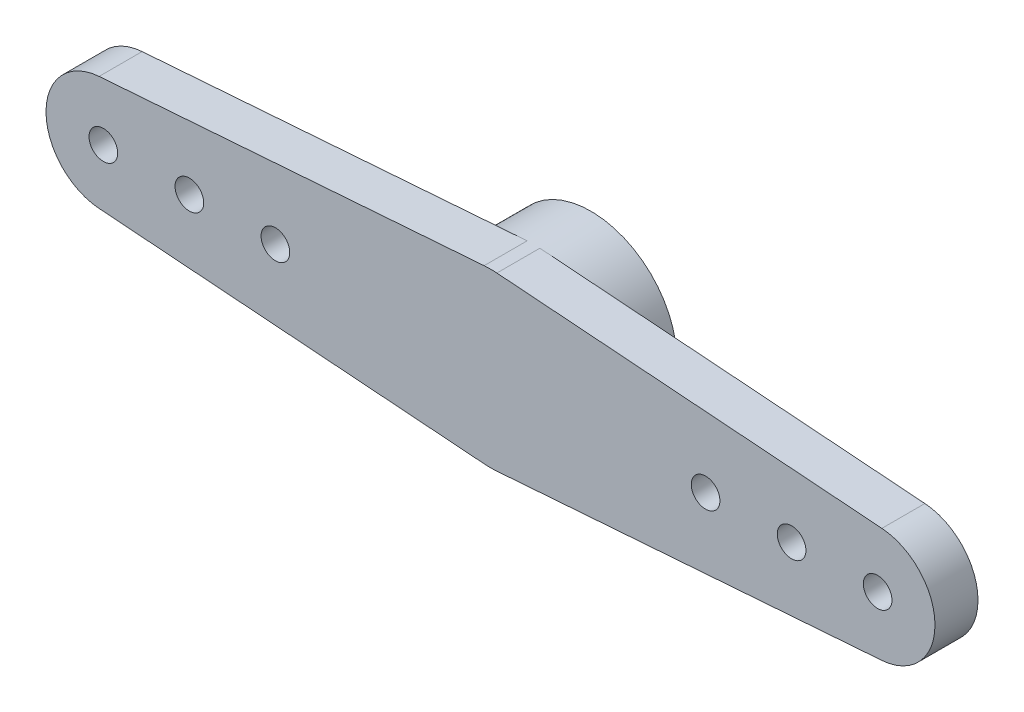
ISO-10303-21;
HEADER;
FILE_DESCRIPTION(('STEP AP214'),'2;1');
FILE_NAME('part.step','',(''),(''),'','','');
FILE_SCHEMA(('AUTOMOTIVE_DESIGN { 1 0 10303 214 1 1 1 1 }'));
ENDSEC;
DATA;
#1=APPLICATION_CONTEXT('core data for automotive mechanical design processes');
#2=APPLICATION_PROTOCOL_DEFINITION('international standard','automotive_design',2000,#1);
#3=PRODUCT_CONTEXT('',#1,'mechanical');
#4=PRODUCT('Part','Part','',(#3));
#5=PRODUCT_RELATED_PRODUCT_CATEGORY('part','',(#4));
#6=PRODUCT_DEFINITION_FORMATION('','',#4);
#7=PRODUCT_DEFINITION_CONTEXT('part definition',#1,'design');
#8=PRODUCT_DEFINITION('design','',#6,#7);
#9=PRODUCT_DEFINITION_SHAPE('','',#8);
#10=(LENGTH_UNIT() NAMED_UNIT(*) SI_UNIT(.MILLI.,.METRE.));
#11=(NAMED_UNIT(*) PLANE_ANGLE_UNIT() SI_UNIT($,.RADIAN.));
#12=(NAMED_UNIT(*) SI_UNIT($,.STERADIAN.) SOLID_ANGLE_UNIT());
#13=UNCERTAINTY_MEASURE_WITH_UNIT(LENGTH_MEASURE(1.E-05),#10,'distance_accuracy_value','');
#14=(GEOMETRIC_REPRESENTATION_CONTEXT(3) GLOBAL_UNCERTAINTY_ASSIGNED_CONTEXT((#13)) GLOBAL_UNIT_ASSIGNED_CONTEXT((#10,
#11,#12)) REPRESENTATION_CONTEXT('',''));
#15=CARTESIAN_POINT('',(0.,0.,0.));
#16=DIRECTION('',(0.,0.,1.));
#17=DIRECTION('',(1.,0.,0.));
#18=AXIS2_PLACEMENT_3D('',#15,#16,#17);
#19=CARTESIAN_POINT('',(0.,0.,0.));
#20=DIRECTION('',(0.,0.,1.));
#21=DIRECTION('',(1.,0.,0.));
#22=AXIS2_PLACEMENT_3D('',#19,#20,#21);
#23=PLANE('',#22);
#24=CARTESIAN_POINT('',(-10.5,0.,0.));
#25=DIRECTION('',(0.,0.,1.));
#26=DIRECTION('',(1.,0.,0.));
#27=AXIS2_PLACEMENT_3D('',#24,#25,#26);
#28=CIRCLE('',#27,0.500000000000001);
#29=CARTESIAN_POINT('',(-10.,0.,0.));
#30=VERTEX_POINT('',#29);
#31=EDGE_CURVE('E181',#30,#30,#28,.T.);
#32=ORIENTED_EDGE('',*,*,#31,.T.);
#33=EDGE_LOOP('',(#32));
#34=FACE_BOUND('',#33,.T.);
#35=CARTESIAN_POINT('',(-13.5,0.,0.));
#36=DIRECTION('',(0.,0.,1.));
#37=DIRECTION('',(1.,0.,0.));
#38=AXIS2_PLACEMENT_3D('',#35,#36,#37);
#39=CIRCLE('',#38,0.500000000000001);
#40=CARTESIAN_POINT('',(-13.,0.,0.));
#41=VERTEX_POINT('',#40);
#42=EDGE_CURVE('E175',#41,#41,#39,.T.);
#43=ORIENTED_EDGE('',*,*,#42,.T.);
#44=EDGE_LOOP('',(#43));
#45=FACE_BOUND('',#44,.T.);
#46=CARTESIAN_POINT('',(-7.5,0.,0.));
#47=DIRECTION('',(0.,0.,1.));
#48=DIRECTION('',(1.,0.,0.));
#49=AXIS2_PLACEMENT_3D('',#46,#47,#48);
#50=CIRCLE('',#49,0.500000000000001);
#51=CARTESIAN_POINT('',(-7.,0.,0.));
#52=VERTEX_POINT('',#51);
#53=EDGE_CURVE('E187',#52,#52,#50,.T.);
#54=ORIENTED_EDGE('',*,*,#53,.T.);
#55=EDGE_LOOP('',(#54));
#56=FACE_BOUND('',#55,.T.);
#57=DIRECTION('',(-0.997252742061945,-0.074074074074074,0.));
#58=VECTOR('',#57,1.);
#59=CARTESIAN_POINT('',(-13.6481481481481,1.99450548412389,0.));
#60=LINE('',#59,#58);
#61=CARTESIAN_POINT('',(-0.222222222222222,2.99175822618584,0.));
#62=VERTEX_POINT('',#61);
#63=CARTESIAN_POINT('',(-13.6481481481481,1.99450548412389,0.));
#64=VERTEX_POINT('',#63);
#65=EDGE_CURVE('E72',#62,#64,#60,.T.);
#66=ORIENTED_EDGE('',*,*,#65,.F.);
#67=CARTESIAN_POINT('',(0.,0.,0.));
#68=DIRECTION('',(0.,0.,1.));
#69=DIRECTION('',(1.,0.,0.));
#70=AXIS2_PLACEMENT_3D('',#67,#68,#69);
#71=CIRCLE('',#70,3.);
#72=CARTESIAN_POINT('',(-0.222222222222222,-2.99175822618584,0.));
#73=VERTEX_POINT('',#72);
#74=EDGE_CURVE('E211',#62,#73,#71,.T.);
#75=ORIENTED_EDGE('',*,*,#74,.T.);
#76=DIRECTION('',(0.997252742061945,-0.074074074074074,0.));
#77=VECTOR('',#76,1.);
#78=CARTESIAN_POINT('',(-13.6481481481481,-1.99450548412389,0.));
#79=LINE('',#78,#77);
#80=CARTESIAN_POINT('',(-13.6481481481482,-1.99450548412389,0.));
#81=VERTEX_POINT('',#80);
#82=EDGE_CURVE('E132',#81,#73,#79,.T.);
#83=ORIENTED_EDGE('',*,*,#82,.F.);
#84=CARTESIAN_POINT('',(-13.5,0.,0.));
#85=DIRECTION('',(0.,0.,1.));
#86=DIRECTION('',(1.,0.,0.));
#87=AXIS2_PLACEMENT_3D('',#84,#85,#86);
#88=CIRCLE('',#87,2.);
#89=EDGE_CURVE('E79',#64,#81,#88,.T.);
#90=ORIENTED_EDGE('',*,*,#89,.F.);
#91=EDGE_LOOP('',(#66,#75,#83,#90));
#92=FACE_BOUND('',#91,.T.);
#93=ADVANCED_FACE('F34',(#34,#45,#56,#92),#23,.F.);
#94=CARTESIAN_POINT('',(0.,0.,1.5));
#95=DIRECTION('',(0.,0.,1.));
#96=DIRECTION('',(1.,0.,0.));
#97=AXIS2_PLACEMENT_3D('',#94,#95,#96);
#98=PLANE('',#97);
#99=DIRECTION('',(-0.997252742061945,0.074074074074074,0.));
#100=VECTOR('',#99,1.);
#101=CARTESIAN_POINT('',(0.222222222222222,2.99175822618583,1.5));
#102=LINE('',#101,#100);
#103=CARTESIAN_POINT('',(13.6481481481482,1.99450548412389,1.5));
#104=VERTEX_POINT('',#103);
#105=CARTESIAN_POINT('',(0.222222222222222,2.99175822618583,1.5));
#106=VERTEX_POINT('',#105);
#107=EDGE_CURVE('E169',#104,#106,#102,.T.);
#108=ORIENTED_EDGE('',*,*,#107,.T.);
#109=CARTESIAN_POINT('',(0.,0.,1.5));
#110=DIRECTION('',(0.,0.,1.));
#111=DIRECTION('',(1.,0.,0.));
#112=AXIS2_PLACEMENT_3D('',#109,#110,#111);
#113=CIRCLE('',#112,3.);
#114=CARTESIAN_POINT('',(-0.222222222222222,2.99175822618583,1.5));
#115=VERTEX_POINT('',#114);
#116=EDGE_CURVE('E108',#106,#115,#113,.T.);
#117=ORIENTED_EDGE('',*,*,#116,.T.);
#118=DIRECTION('',(-0.997252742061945,-0.074074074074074,0.));
#119=VECTOR('',#118,1.);
#120=CARTESIAN_POINT('',(-13.6481481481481,1.99450548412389,1.5));
#121=LINE('',#120,#119);
#122=CARTESIAN_POINT('',(-13.6481481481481,1.99450548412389,1.5));
#123=VERTEX_POINT('',#122);
#124=EDGE_CURVE('E102',#115,#123,#121,.T.);
#125=ORIENTED_EDGE('',*,*,#124,.T.);
#126=CARTESIAN_POINT('',(-13.5,0.,1.5));
#127=DIRECTION('',(0.,0.,1.));
#128=DIRECTION('',(1.,0.,0.));
#129=AXIS2_PLACEMENT_3D('',#126,#127,#128);
#130=CIRCLE('',#129,2.);
#131=CARTESIAN_POINT('',(-13.6481481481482,-1.99450548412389,1.5));
#132=VERTEX_POINT('',#131);
#133=EDGE_CURVE('E106',#123,#132,#130,.T.);
#134=ORIENTED_EDGE('',*,*,#133,.T.);
#135=DIRECTION('',(0.997252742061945,-0.074074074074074,0.));
#136=VECTOR('',#135,1.);
#137=CARTESIAN_POINT('',(-13.6481481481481,-1.99450548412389,1.5));
#138=LINE('',#137,#136);
#139=CARTESIAN_POINT('',(-0.222222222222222,-2.99175822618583,1.5));
#140=VERTEX_POINT('',#139);
#141=EDGE_CURVE('E51',#132,#140,#138,.T.);
#142=ORIENTED_EDGE('',*,*,#141,.T.);
#143=CARTESIAN_POINT('',(0.,0.,1.5));
#144=DIRECTION('',(0.,0.,1.));
#145=DIRECTION('',(1.,0.,0.));
#146=AXIS2_PLACEMENT_3D('',#143,#144,#145);
#147=CIRCLE('',#146,3.);
#148=CARTESIAN_POINT('',(0.222222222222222,-2.99175822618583,1.5));
#149=VERTEX_POINT('',#148);
#150=EDGE_CURVE('E135',#140,#149,#147,.T.);
#151=ORIENTED_EDGE('',*,*,#150,.T.);
#152=DIRECTION('',(0.997252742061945,0.074074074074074,0.));
#153=VECTOR('',#152,1.);
#154=CARTESIAN_POINT('',(13.6481481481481,-1.99450548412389,1.5));
#155=LINE('',#154,#153);
#156=CARTESIAN_POINT('',(13.6481481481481,-1.99450548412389,1.5));
#157=VERTEX_POINT('',#156);
#158=EDGE_CURVE('E87',#149,#157,#155,.T.);
#159=ORIENTED_EDGE('',*,*,#158,.T.);
#160=CARTESIAN_POINT('',(13.5,0.,1.5));
#161=DIRECTION('',(0.,0.,1.));
#162=DIRECTION('',(1.,0.,0.));
#163=AXIS2_PLACEMENT_3D('',#160,#161,#162);
#164=CIRCLE('',#163,2.);
#165=EDGE_CURVE('E151',#157,#104,#164,.T.);
#166=ORIENTED_EDGE('',*,*,#165,.T.);
#167=EDGE_LOOP('',(#108,#117,#125,#134,#142,#151,#159,#166));
#168=FACE_BOUND('',#167,.T.);
#169=CARTESIAN_POINT('',(10.5,0.,1.5));
#170=DIRECTION('',(0.,0.,1.));
#171=DIRECTION('',(1.,0.,0.));
#172=AXIS2_PLACEMENT_3D('',#169,#170,#171);
#173=CIRCLE('',#172,0.500000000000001);
#174=CARTESIAN_POINT('',(11.,0.,1.5));
#175=VERTEX_POINT('',#174);
#176=EDGE_CURVE('E196',#175,#175,#173,.T.);
#177=ORIENTED_EDGE('',*,*,#176,.F.);
#178=EDGE_LOOP('',(#177));
#179=FACE_BOUND('',#178,.T.);
#180=CARTESIAN_POINT('',(7.5,0.,1.5));
#181=DIRECTION('',(0.,0.,1.));
#182=DIRECTION('',(1.,0.,0.));
#183=AXIS2_PLACEMENT_3D('',#180,#181,#182);
#184=CIRCLE('',#183,0.500000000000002);
#185=CARTESIAN_POINT('',(8.,0.,1.5));
#186=VERTEX_POINT('',#185);
#187=EDGE_CURVE('E190',#186,#186,#184,.T.);
#188=ORIENTED_EDGE('',*,*,#187,.F.);
#189=EDGE_LOOP('',(#188));
#190=FACE_BOUND('',#189,.T.);
#191=CARTESIAN_POINT('',(13.5,0.,1.5));
#192=DIRECTION('',(0.,0.,1.));
#193=DIRECTION('',(1.,0.,0.));
#194=AXIS2_PLACEMENT_3D('',#191,#192,#193);
#195=CIRCLE('',#194,0.500000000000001);
#196=CARTESIAN_POINT('',(14.,0.,1.5));
#197=VERTEX_POINT('',#196);
#198=EDGE_CURVE('E202',#197,#197,#195,.T.);
#199=ORIENTED_EDGE('',*,*,#198,.F.);
#200=EDGE_LOOP('',(#199));
#201=FACE_BOUND('',#200,.T.);
#202=CARTESIAN_POINT('',(-10.5,0.,1.5));
#203=DIRECTION('',(0.,0.,1.));
#204=DIRECTION('',(1.,0.,0.));
#205=AXIS2_PLACEMENT_3D('',#202,#203,#204);
#206=CIRCLE('',#205,0.500000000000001);
#207=CARTESIAN_POINT('',(-10.,0.,1.5));
#208=VERTEX_POINT('',#207);
#209=EDGE_CURVE('E178',#208,#208,#206,.T.);
#210=ORIENTED_EDGE('',*,*,#209,.F.);
#211=EDGE_LOOP('',(#210));
#212=FACE_BOUND('',#211,.T.);
#213=CARTESIAN_POINT('',(-13.5,0.,1.5));
#214=DIRECTION('',(0.,0.,1.));
#215=DIRECTION('',(1.,0.,0.));
#216=AXIS2_PLACEMENT_3D('',#213,#214,#215);
#217=CIRCLE('',#216,0.500000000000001);
#218=CARTESIAN_POINT('',(-13.,0.,1.5));
#219=VERTEX_POINT('',#218);
#220=EDGE_CURVE('E125',#219,#219,#217,.T.);
#221=ORIENTED_EDGE('',*,*,#220,.F.);
#222=EDGE_LOOP('',(#221));
#223=FACE_BOUND('',#222,.T.);
#224=CARTESIAN_POINT('',(-7.5,0.,1.5));
#225=DIRECTION('',(0.,0.,1.));
#226=DIRECTION('',(1.,0.,0.));
#227=AXIS2_PLACEMENT_3D('',#224,#225,#226);
#228=CIRCLE('',#227,0.500000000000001);
#229=CARTESIAN_POINT('',(-7.,0.,1.5));
#230=VERTEX_POINT('',#229);
#231=EDGE_CURVE('E184',#230,#230,#228,.T.);
#232=ORIENTED_EDGE('',*,*,#231,.F.);
#233=EDGE_LOOP('',(#232));
#234=FACE_BOUND('',#233,.T.);
#235=ADVANCED_FACE('F103',(#168,#179,#190,#201,#212,#223,#234),#98,.T.);
#236=CARTESIAN_POINT('',(10.5,0.,0.));
#237=DIRECTION('',(0.,0.,1.));
#238=DIRECTION('',(1.,0.,0.));
#239=AXIS2_PLACEMENT_3D('',#236,#237,#238);
#240=CIRCLE('',#239,0.500000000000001);
#241=CARTESIAN_POINT('',(11.,0.,0.));
#242=VERTEX_POINT('',#241);
#243=EDGE_CURVE('E199',#242,#242,#240,.T.);
#244=ORIENTED_EDGE('',*,*,#243,.T.);
#245=EDGE_LOOP('',(#244));
#246=FACE_BOUND('',#245,.T.);
#247=DIRECTION('',(0.997252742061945,0.074074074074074,0.));
#248=VECTOR('',#247,1.);
#249=CARTESIAN_POINT('',(13.6481481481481,-1.99450548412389,0.));
#250=LINE('',#249,#248);
#251=CARTESIAN_POINT('',(0.222222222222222,-2.99175822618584,0.));
#252=VERTEX_POINT('',#251);
#253=CARTESIAN_POINT('',(13.6481481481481,-1.99450548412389,0.));
#254=VERTEX_POINT('',#253);
#255=EDGE_CURVE('E122',#252,#254,#250,.T.);
#256=ORIENTED_EDGE('',*,*,#255,.F.);
#257=CARTESIAN_POINT('',(0.222222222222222,2.99175822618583,0.));
#258=VERTEX_POINT('',#257);
#259=EDGE_CURVE('E159',#252,#258,#71,.T.);
#260=ORIENTED_EDGE('',*,*,#259,.T.);
#261=DIRECTION('',(-0.997252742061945,0.074074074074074,0.));
#262=VECTOR('',#261,1.);
#263=CARTESIAN_POINT('',(0.222222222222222,2.99175822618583,0.));
#264=LINE('',#263,#262);
#265=CARTESIAN_POINT('',(13.6481481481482,1.99450548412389,0.));
#266=VERTEX_POINT('',#265);
#267=EDGE_CURVE('E127',#266,#258,#264,.T.);
#268=ORIENTED_EDGE('',*,*,#267,.F.);
#269=CARTESIAN_POINT('',(13.5,0.,0.));
#270=DIRECTION('',(0.,0.,1.));
#271=DIRECTION('',(1.,0.,0.));
#272=AXIS2_PLACEMENT_3D('',#269,#270,#271);
#273=CIRCLE('',#272,2.);
#274=EDGE_CURVE('E124',#254,#266,#273,.T.);
#275=ORIENTED_EDGE('',*,*,#274,.F.);
#276=EDGE_LOOP('',(#256,#260,#268,#275));
#277=FACE_BOUND('',#276,.T.);
#278=CARTESIAN_POINT('',(7.5,0.,0.));
#279=DIRECTION('',(0.,0.,1.));
#280=DIRECTION('',(1.,0.,0.));
#281=AXIS2_PLACEMENT_3D('',#278,#279,#280);
#282=CIRCLE('',#281,0.500000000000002);
#283=CARTESIAN_POINT('',(8.,0.,0.));
#284=VERTEX_POINT('',#283);
#285=EDGE_CURVE('E193',#284,#284,#282,.T.);
#286=ORIENTED_EDGE('',*,*,#285,.T.);
#287=EDGE_LOOP('',(#286));
#288=FACE_BOUND('',#287,.T.);
#289=CARTESIAN_POINT('',(13.5,0.,0.));
#290=DIRECTION('',(0.,0.,1.));
#291=DIRECTION('',(1.,0.,0.));
#292=AXIS2_PLACEMENT_3D('',#289,#290,#291);
#293=CIRCLE('',#292,0.500000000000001);
#294=CARTESIAN_POINT('',(14.,0.,0.));
#295=VERTEX_POINT('',#294);
#296=EDGE_CURVE('E205',#295,#295,#293,.T.);
#297=ORIENTED_EDGE('',*,*,#296,.T.);
#298=EDGE_LOOP('',(#297));
#299=FACE_BOUND('',#298,.T.);
#300=ADVANCED_FACE('F155',(#246,#277,#288,#299),#23,.F.);
#301=CARTESIAN_POINT('',(13.6481481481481,-1.99450548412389,1.5));
#302=DIRECTION('',(-0.074074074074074,0.997252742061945,0.));
#303=DIRECTION('',(-0.997252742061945,-0.074074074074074,0.));
#304=AXIS2_PLACEMENT_3D('',#301,#302,#303);
#305=PLANE('',#304);
#306=ORIENTED_EDGE('',*,*,#255,.T.);
#307=DIRECTION('',(0.,0.,-1.));
#308=VECTOR('',#307,1.);
#309=CARTESIAN_POINT('',(13.6481481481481,-1.99450548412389,1.5));
#310=LINE('',#309,#308);
#311=EDGE_CURVE('E43',#157,#254,#310,.T.);
#312=ORIENTED_EDGE('',*,*,#311,.F.);
#313=ORIENTED_EDGE('',*,*,#158,.F.);
#314=DIRECTION('',(0.,0.,-1.));
#315=VECTOR('',#314,1.);
#316=CARTESIAN_POINT('',(0.222222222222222,-2.99175822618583,1.5));
#317=LINE('',#316,#315);
#318=EDGE_CURVE('E11',#149,#252,#317,.T.);
#319=ORIENTED_EDGE('',*,*,#318,.T.);
#320=EDGE_LOOP('',(#306,#312,#313,#319));
#321=FACE_BOUND('',#320,.T.);
#322=ADVANCED_FACE('F36',(#321),#305,.F.);
#323=CARTESIAN_POINT('',(13.5,0.,1.5));
#324=DIRECTION('',(0.,0.,-1.));
#325=DIRECTION('',(-1.,0.,0.));
#326=AXIS2_PLACEMENT_3D('',#323,#324,#325);
#327=CYLINDRICAL_SURFACE('',#326,2.);
#328=ORIENTED_EDGE('',*,*,#274,.T.);
#329=DIRECTION('',(0.,0.,-1.));
#330=VECTOR('',#329,1.);
#331=CARTESIAN_POINT('',(13.6481481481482,1.99450548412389,1.5));
#332=LINE('',#331,#330);
#333=EDGE_CURVE('E143',#104,#266,#332,.T.);
#334=ORIENTED_EDGE('',*,*,#333,.F.);
#335=ORIENTED_EDGE('',*,*,#165,.F.);
#336=ORIENTED_EDGE('',*,*,#311,.T.);
#337=EDGE_LOOP('',(#328,#334,#335,#336));
#338=FACE_BOUND('',#337,.T.);
#339=ADVANCED_FACE('F149',(#338),#327,.T.);
#340=CARTESIAN_POINT('',(0.222222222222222,2.99175822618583,1.5));
#341=DIRECTION('',(-0.074074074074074,-0.997252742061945,0.));
#342=DIRECTION('',(0.997252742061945,-0.074074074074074,0.));
#343=AXIS2_PLACEMENT_3D('',#340,#341,#342);
#344=PLANE('',#343);
#345=ORIENTED_EDGE('',*,*,#267,.T.);
#346=DIRECTION('',(0.,0.,-1.));
#347=VECTOR('',#346,1.);
#348=CARTESIAN_POINT('',(0.222222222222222,2.99175822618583,1.5));
#349=LINE('',#348,#347);
#350=EDGE_CURVE('E140',#106,#258,#349,.T.);
#351=ORIENTED_EDGE('',*,*,#350,.F.);
#352=ORIENTED_EDGE('',*,*,#107,.F.);
#353=ORIENTED_EDGE('',*,*,#333,.T.);
#354=EDGE_LOOP('',(#345,#351,#352,#353));
#355=FACE_BOUND('',#354,.T.);
#356=ADVANCED_FACE('F162',(#355),#344,.F.);
#357=CARTESIAN_POINT('',(0.,0.,1.5));
#358=DIRECTION('',(0.,0.,-1.));
#359=DIRECTION('',(-1.,0.,0.));
#360=AXIS2_PLACEMENT_3D('',#357,#358,#359);
#361=CYLINDRICAL_SURFACE('',#360,3.);
#362=ORIENTED_EDGE('',*,*,#350,.T.);
#363=ORIENTED_EDGE('',*,*,#259,.F.);
#364=ORIENTED_EDGE('',*,*,#318,.F.);
#365=ORIENTED_EDGE('',*,*,#150,.F.);
#366=DIRECTION('',(0.,0.,-1.));
#367=VECTOR('',#366,1.);
#368=CARTESIAN_POINT('',(-0.222222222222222,-2.99175822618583,1.5));
#369=LINE('',#368,#367);
#370=EDGE_CURVE('E118',#140,#73,#369,.T.);
#371=ORIENTED_EDGE('',*,*,#370,.T.);
#372=ORIENTED_EDGE('',*,*,#74,.F.);
#373=DIRECTION('',(0.,0.,-1.));
#374=VECTOR('',#373,1.);
#375=CARTESIAN_POINT('',(-0.222222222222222,2.99175822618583,1.5));
#376=LINE('',#375,#374);
#377=EDGE_CURVE('E113',#115,#62,#376,.T.);
#378=ORIENTED_EDGE('',*,*,#377,.F.);
#379=ORIENTED_EDGE('',*,*,#116,.F.);
#380=EDGE_LOOP('',(#362,#363,#364,#365,#371,#372,#378,#379));
#381=FACE_BOUND('',#380,.T.);
#382=CARTESIAN_POINT('',(0.,0.,-2.));
#383=DIRECTION('',(0.,0.,-1.));
#384=DIRECTION('',(-1.,0.,0.));
#385=AXIS2_PLACEMENT_3D('',#382,#383,#384);
#386=CIRCLE('',#385,3.);
#387=CARTESIAN_POINT('',(-3.,0.,-2.));
#388=VERTEX_POINT('',#387);
#389=EDGE_CURVE('E212',#388,#388,#386,.T.);
#390=ORIENTED_EDGE('',*,*,#389,.F.);
#391=EDGE_LOOP('',(#390));
#392=FACE_BOUND('',#391,.T.);
#393=ADVANCED_FACE('F165',(#381,#392),#361,.T.);
#394=CARTESIAN_POINT('',(-13.6481481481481,1.99450548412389,1.5));
#395=DIRECTION('',(0.074074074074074,-0.997252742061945,0.));
#396=DIRECTION('',(0.997252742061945,0.074074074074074,0.));
#397=AXIS2_PLACEMENT_3D('',#394,#395,#396);
#398=PLANE('',#397);
#399=ORIENTED_EDGE('',*,*,#65,.T.);
#400=DIRECTION('',(0.,0.,-1.));
#401=VECTOR('',#400,1.);
#402=CARTESIAN_POINT('',(-13.6481481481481,1.99450548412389,1.5));
#403=LINE('',#402,#401);
#404=EDGE_CURVE('E111',#123,#64,#403,.T.);
#405=ORIENTED_EDGE('',*,*,#404,.F.);
#406=ORIENTED_EDGE('',*,*,#124,.F.);
#407=ORIENTED_EDGE('',*,*,#377,.T.);
#408=EDGE_LOOP('',(#399,#405,#406,#407));
#409=FACE_BOUND('',#408,.T.);
#410=ADVANCED_FACE('F112',(#409),#398,.F.);
#411=CARTESIAN_POINT('',(-13.5,0.,1.5));
#412=DIRECTION('',(0.,0.,-1.));
#413=DIRECTION('',(-1.,0.,0.));
#414=AXIS2_PLACEMENT_3D('',#411,#412,#413);
#415=CYLINDRICAL_SURFACE('',#414,2.);
#416=ORIENTED_EDGE('',*,*,#89,.T.);
#417=DIRECTION('',(0.,0.,-1.));
#418=VECTOR('',#417,1.);
#419=CARTESIAN_POINT('',(-13.6481481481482,-1.99450548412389,1.5));
#420=LINE('',#419,#418);
#421=EDGE_CURVE('E114',#132,#81,#420,.T.);
#422=ORIENTED_EDGE('',*,*,#421,.F.);
#423=ORIENTED_EDGE('',*,*,#133,.F.);
#424=ORIENTED_EDGE('',*,*,#404,.T.);
#425=EDGE_LOOP('',(#416,#422,#423,#424));
#426=FACE_BOUND('',#425,.T.);
#427=ADVANCED_FACE('F116',(#426),#415,.T.);
#428=CARTESIAN_POINT('',(-13.6481481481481,-1.99450548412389,1.5));
#429=DIRECTION('',(0.074074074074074,0.997252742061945,0.));
#430=DIRECTION('',(-0.997252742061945,0.074074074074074,0.));
#431=AXIS2_PLACEMENT_3D('',#428,#429,#430);
#432=PLANE('',#431);
#433=ORIENTED_EDGE('',*,*,#82,.T.);
#434=ORIENTED_EDGE('',*,*,#370,.F.);
#435=ORIENTED_EDGE('',*,*,#141,.F.);
#436=ORIENTED_EDGE('',*,*,#421,.T.);
#437=EDGE_LOOP('',(#433,#434,#435,#436));
#438=FACE_BOUND('',#437,.T.);
#439=ADVANCED_FACE('F284',(#438),#432,.F.);
#440=CARTESIAN_POINT('',(-13.5,0.,1.5));
#441=DIRECTION('',(0.,0.,-1.));
#442=DIRECTION('',(-1.,0.,0.));
#443=AXIS2_PLACEMENT_3D('',#440,#441,#442);
#444=CYLINDRICAL_SURFACE('',#443,0.500000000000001);
#445=ORIENTED_EDGE('',*,*,#220,.T.);
#446=EDGE_LOOP('',(#445));
#447=FACE_BOUND('',#446,.T.);
#448=ORIENTED_EDGE('',*,*,#42,.F.);
#449=EDGE_LOOP('',(#448));
#450=FACE_BOUND('',#449,.T.);
#451=ADVANCED_FACE('F281',(#447,#450),#444,.F.);
#452=CARTESIAN_POINT('',(-10.5,0.,1.5));
#453=DIRECTION('',(0.,0.,-1.));
#454=DIRECTION('',(-1.,0.,0.));
#455=AXIS2_PLACEMENT_3D('',#452,#453,#454);
#456=CYLINDRICAL_SURFACE('',#455,0.500000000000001);
#457=ORIENTED_EDGE('',*,*,#209,.T.);
#458=EDGE_LOOP('',(#457));
#459=FACE_BOUND('',#458,.T.);
#460=ORIENTED_EDGE('',*,*,#31,.F.);
#461=EDGE_LOOP('',(#460));
#462=FACE_BOUND('',#461,.T.);
#463=ADVANCED_FACE('F277',(#459,#462),#456,.F.);
#464=CARTESIAN_POINT('',(-7.5,0.,1.5));
#465=DIRECTION('',(0.,0.,-1.));
#466=DIRECTION('',(-1.,0.,0.));
#467=AXIS2_PLACEMENT_3D('',#464,#465,#466);
#468=CYLINDRICAL_SURFACE('',#467,0.500000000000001);
#469=ORIENTED_EDGE('',*,*,#231,.T.);
#470=EDGE_LOOP('',(#469));
#471=FACE_BOUND('',#470,.T.);
#472=ORIENTED_EDGE('',*,*,#53,.F.);
#473=EDGE_LOOP('',(#472));
#474=FACE_BOUND('',#473,.T.);
#475=ADVANCED_FACE('F271',(#471,#474),#468,.F.);
#476=CARTESIAN_POINT('',(7.5,0.,1.5));
#477=DIRECTION('',(0.,0.,-1.));
#478=DIRECTION('',(-1.,0.,0.));
#479=AXIS2_PLACEMENT_3D('',#476,#477,#478);
#480=CYLINDRICAL_SURFACE('',#479,0.500000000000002);
#481=ORIENTED_EDGE('',*,*,#187,.T.);
#482=EDGE_LOOP('',(#481));
#483=FACE_BOUND('',#482,.T.);
#484=ORIENTED_EDGE('',*,*,#285,.F.);
#485=EDGE_LOOP('',(#484));
#486=FACE_BOUND('',#485,.T.);
#487=ADVANCED_FACE('F262',(#483,#486),#480,.F.);
#488=CARTESIAN_POINT('',(10.5,0.,1.5));
#489=DIRECTION('',(0.,0.,-1.));
#490=DIRECTION('',(-1.,0.,0.));
#491=AXIS2_PLACEMENT_3D('',#488,#489,#490);
#492=CYLINDRICAL_SURFACE('',#491,0.500000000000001);
#493=ORIENTED_EDGE('',*,*,#176,.T.);
#494=EDGE_LOOP('',(#493));
#495=FACE_BOUND('',#494,.T.);
#496=ORIENTED_EDGE('',*,*,#243,.F.);
#497=EDGE_LOOP('',(#496));
#498=FACE_BOUND('',#497,.T.);
#499=ADVANCED_FACE('F260',(#495,#498),#492,.F.);
#500=CARTESIAN_POINT('',(13.5,0.,1.5));
#501=DIRECTION('',(0.,0.,-1.));
#502=DIRECTION('',(-1.,0.,0.));
#503=AXIS2_PLACEMENT_3D('',#500,#501,#502);
#504=CYLINDRICAL_SURFACE('',#503,0.500000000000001);
#505=ORIENTED_EDGE('',*,*,#198,.T.);
#506=EDGE_LOOP('',(#505));
#507=FACE_BOUND('',#506,.T.);
#508=ORIENTED_EDGE('',*,*,#296,.F.);
#509=EDGE_LOOP('',(#508));
#510=FACE_BOUND('',#509,.T.);
#511=ADVANCED_FACE('F233',(#507,#510),#504,.F.);
#512=CARTESIAN_POINT('',(0.,0.,-2.));
#513=DIRECTION('',(0.,0.,-1.));
#514=DIRECTION('',(-1.,0.,0.));
#515=AXIS2_PLACEMENT_3D('',#512,#513,#514);
#516=PLANE('',#515);
#517=CARTESIAN_POINT('',(0.,0.,-2.));
#518=DIRECTION('',(0.,0.,-1.));
#519=DIRECTION('',(-1.,0.,0.));
#520=AXIS2_PLACEMENT_3D('',#517,#518,#519);
#521=CIRCLE('',#520,2.);
#522=CARTESIAN_POINT('',(-2.,0.,-2.));
#523=VERTEX_POINT('',#522);
#524=EDGE_CURVE('E216',#523,#523,#521,.T.);
#525=ORIENTED_EDGE('',*,*,#524,.F.);
#526=EDGE_LOOP('',(#525));
#527=FACE_BOUND('',#526,.T.);
#528=ORIENTED_EDGE('',*,*,#389,.T.);
#529=EDGE_LOOP('',(#528));
#530=FACE_BOUND('',#529,.T.);
#531=ADVANCED_FACE('F227',(#527,#530),#516,.T.);
#532=CARTESIAN_POINT('',(0.,0.,0.6));
#533=DIRECTION('',(0.,0.,-1.));
#534=DIRECTION('',(-1.,0.,0.));
#535=AXIS2_PLACEMENT_3D('',#532,#533,#534);
#536=CYLINDRICAL_SURFACE('',#535,2.);
#537=CARTESIAN_POINT('',(0.,0.,0.6));
#538=DIRECTION('',(0.,0.,-1.));
#539=DIRECTION('',(-1.,0.,0.));
#540=AXIS2_PLACEMENT_3D('',#537,#538,#539);
#541=CIRCLE('',#540,2.);
#542=CARTESIAN_POINT('',(-2.,0.,0.6));
#543=VERTEX_POINT('',#542);
#544=EDGE_CURVE('E215',#543,#543,#541,.T.);
#545=ORIENTED_EDGE('',*,*,#544,.F.);
#546=EDGE_LOOP('',(#545));
#547=FACE_BOUND('',#546,.T.);
#548=ORIENTED_EDGE('',*,*,#524,.T.);
#549=EDGE_LOOP('',(#548));
#550=FACE_BOUND('',#549,.T.);
#551=ADVANCED_FACE('F224',(#547,#550),#536,.F.);
#552=CARTESIAN_POINT('',(0.,0.,0.6));
#553=DIRECTION('',(0.,0.,-1.));
#554=DIRECTION('',(-1.,0.,0.));
#555=AXIS2_PLACEMENT_3D('',#552,#553,#554);
#556=PLANE('',#555);
#557=ORIENTED_EDGE('',*,*,#544,.T.);
#558=EDGE_LOOP('',(#557));
#559=FACE_BOUND('',#558,.T.);
#560=ADVANCED_FACE('F222',(#559),#556,.T.);
#561=CLOSED_SHELL('',(#93,#235,#300,#322,#339,#356,#393,#410,#427,#439,#451,#463,#475,#487,#499,
#511,#531,#551,#560));
#562=MANIFOLD_SOLID_BREP('B2',#561);
#563=ADVANCED_BREP_SHAPE_REPRESENTATION('',(#18,#562),#14);
#564=SHAPE_DEFINITION_REPRESENTATION(#9,#563);
ENDSEC;
END-ISO-10303-21;
